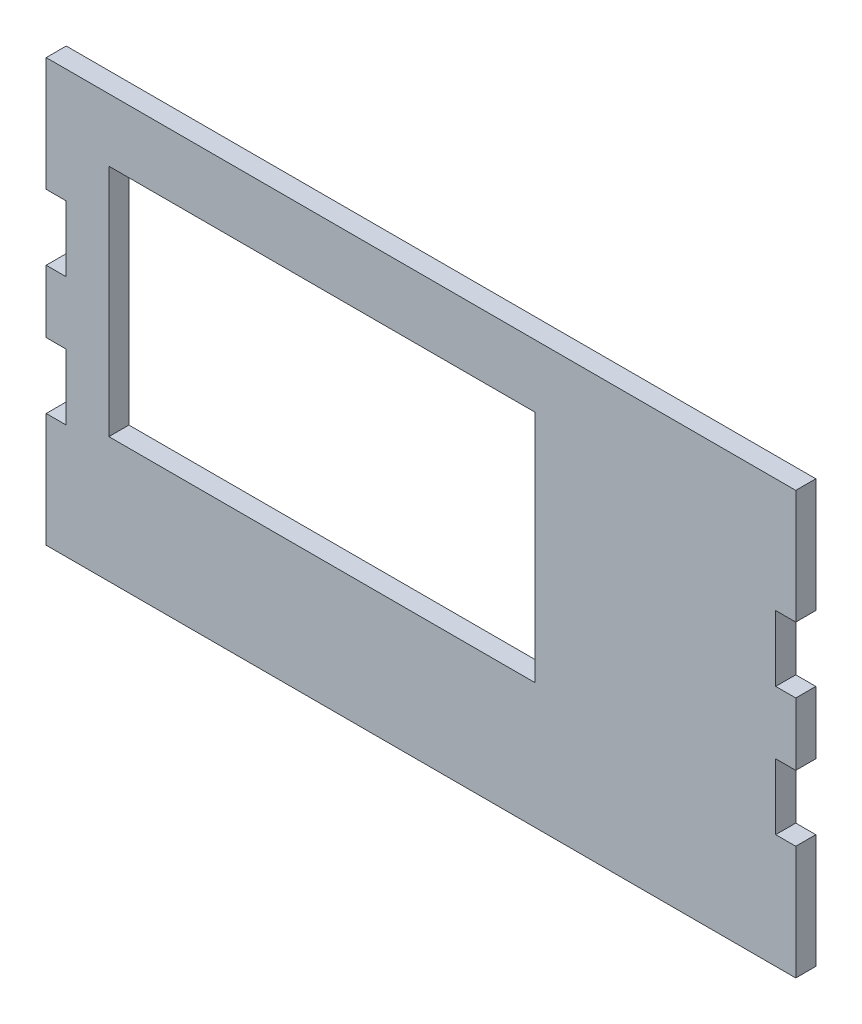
ISO-10303-21;
HEADER;
FILE_DESCRIPTION(('STEP AP214'),'2;1');
FILE_NAME('part.step','',(''),(''),'','','');
FILE_SCHEMA(('AUTOMOTIVE_DESIGN { 1 0 10303 214 1 1 1 1 }'));
ENDSEC;
DATA;
#1=APPLICATION_CONTEXT('core data for automotive mechanical design processes');
#2=APPLICATION_PROTOCOL_DEFINITION('international standard','automotive_design',2000,#1);
#3=PRODUCT_CONTEXT('',#1,'mechanical');
#4=PRODUCT('Part','Part','',(#3));
#5=PRODUCT_RELATED_PRODUCT_CATEGORY('part','',(#4));
#6=PRODUCT_DEFINITION_FORMATION('','',#4);
#7=PRODUCT_DEFINITION_CONTEXT('part definition',#1,'design');
#8=PRODUCT_DEFINITION('design','',#6,#7);
#9=PRODUCT_DEFINITION_SHAPE('','',#8);
#10=(LENGTH_UNIT() NAMED_UNIT(*) SI_UNIT(.MILLI.,.METRE.));
#11=(NAMED_UNIT(*) PLANE_ANGLE_UNIT() SI_UNIT($,.RADIAN.));
#12=(NAMED_UNIT(*) SI_UNIT($,.STERADIAN.) SOLID_ANGLE_UNIT());
#13=UNCERTAINTY_MEASURE_WITH_UNIT(LENGTH_MEASURE(1.E-05),#10,'distance_accuracy_value','');
#14=(GEOMETRIC_REPRESENTATION_CONTEXT(3) GLOBAL_UNCERTAINTY_ASSIGNED_CONTEXT((#13)) GLOBAL_UNIT_ASSIGNED_CONTEXT((#10,
#11,#12)) REPRESENTATION_CONTEXT('',''));
#15=CARTESIAN_POINT('',(0.,0.,0.));
#16=DIRECTION('',(0.,0.,1.));
#17=DIRECTION('',(1.,0.,0.));
#18=AXIS2_PLACEMENT_3D('',#15,#16,#17);
#19=CARTESIAN_POINT('',(581.8,-16.,16.));
#20=DIRECTION('',(0.,-1.,0.));
#21=DIRECTION('',(1.,0.,0.));
#22=AXIS2_PLACEMENT_3D('',#19,#20,#21);
#23=PLANE('',#22);
#24=DIRECTION('',(-1.,0.,0.));
#25=VECTOR('',#24,1.);
#26=CARTESIAN_POINT('',(581.8,-16.,0.));
#27=LINE('',#26,#25);
#28=CARTESIAN_POINT('',(581.8,-16.,0.));
#29=VERTEX_POINT('',#28);
#30=CARTESIAN_POINT('',(-16.,-16.0000000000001,0.));
#31=VERTEX_POINT('',#30);
#32=EDGE_CURVE('E312',#29,#31,#27,.T.);
#33=ORIENTED_EDGE('',*,*,#32,.F.);
#34=DIRECTION('',(0.,0.,-1.));
#35=VECTOR('',#34,1.);
#36=CARTESIAN_POINT('',(581.8,-16.,16.));
#37=LINE('',#36,#35);
#38=CARTESIAN_POINT('',(581.8,-16.,16.));
#39=VERTEX_POINT('',#38);
#40=EDGE_CURVE('E12',#39,#29,#37,.T.);
#41=ORIENTED_EDGE('',*,*,#40,.F.);
#42=DIRECTION('',(-1.,0.,0.));
#43=VECTOR('',#42,1.);
#44=CARTESIAN_POINT('',(581.8,-16.,16.));
#45=LINE('',#44,#43);
#46=CARTESIAN_POINT('',(-16.,-16.0000000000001,16.));
#47=VERTEX_POINT('',#46);
#48=EDGE_CURVE('E316',#39,#47,#45,.T.);
#49=ORIENTED_EDGE('',*,*,#48,.T.);
#50=DIRECTION('',(0.,0.,-1.));
#51=VECTOR('',#50,1.);
#52=CARTESIAN_POINT('',(-16.,-16.0000000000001,16.));
#53=LINE('',#52,#51);
#54=EDGE_CURVE('E123',#47,#31,#53,.T.);
#55=ORIENTED_EDGE('',*,*,#54,.T.);
#56=EDGE_LOOP('',(#33,#41,#49,#55));
#57=FACE_BOUND('',#56,.T.);
#58=ADVANCED_FACE('F120',(#57),#23,.T.);
#59=CARTESIAN_POINT('',(581.8,-16.,16.));
#60=DIRECTION('',(-1.,0.,0.));
#61=DIRECTION('',(0.,0.,1.));
#62=AXIS2_PLACEMENT_3D('',#59,#60,#61);
#63=PLANE('',#62);
#64=DIRECTION('',(0.,1.,0.));
#65=VECTOR('',#64,1.);
#66=CARTESIAN_POINT('',(581.8,-16.,0.));
#67=LINE('',#66,#65);
#68=CARTESIAN_POINT('',(581.8,75.,0.));
#69=VERTEX_POINT('',#68);
#70=EDGE_CURVE('E320',#29,#69,#67,.T.);
#71=ORIENTED_EDGE('',*,*,#70,.T.);
#72=DIRECTION('',(0.,0.,-1.));
#73=VECTOR('',#72,1.);
#74=CARTESIAN_POINT('',(581.8,75.,16.));
#75=LINE('',#74,#73);
#76=CARTESIAN_POINT('',(581.8,75.,16.));
#77=VERTEX_POINT('',#76);
#78=EDGE_CURVE('E128',#77,#69,#75,.T.);
#79=ORIENTED_EDGE('',*,*,#78,.F.);
#80=DIRECTION('',(0.,1.,0.));
#81=VECTOR('',#80,1.);
#82=CARTESIAN_POINT('',(581.8,-16.,16.));
#83=LINE('',#82,#81);
#84=EDGE_CURVE('E366',#39,#77,#83,.T.);
#85=ORIENTED_EDGE('',*,*,#84,.F.);
#86=ORIENTED_EDGE('',*,*,#40,.T.);
#87=EDGE_LOOP('',(#71,#79,#85,#86));
#88=FACE_BOUND('',#87,.T.);
#89=ADVANCED_FACE('F478',(#88),#63,.F.);
#90=CARTESIAN_POINT('',(565.8,75.,16.));
#91=DIRECTION('',(0.,1.,0.));
#92=DIRECTION('',(0.,0.,1.));
#93=AXIS2_PLACEMENT_3D('',#90,#91,#92);
#94=PLANE('',#93);
#95=DIRECTION('',(1.,0.,0.));
#96=VECTOR('',#95,1.);
#97=CARTESIAN_POINT('',(565.8,75.,0.));
#98=LINE('',#97,#96);
#99=CARTESIAN_POINT('',(565.8,75.,0.));
#100=VERTEX_POINT('',#99);
#101=EDGE_CURVE('E418',#100,#69,#98,.T.);
#102=ORIENTED_EDGE('',*,*,#101,.F.);
#103=DIRECTION('',(0.,0.,-1.));
#104=VECTOR('',#103,1.);
#105=CARTESIAN_POINT('',(565.8,75.,16.));
#106=LINE('',#105,#104);
#107=CARTESIAN_POINT('',(565.8,75.,16.));
#108=VERTEX_POINT('',#107);
#109=EDGE_CURVE('E424',#108,#100,#106,.T.);
#110=ORIENTED_EDGE('',*,*,#109,.F.);
#111=DIRECTION('',(1.,0.,0.));
#112=VECTOR('',#111,1.);
#113=CARTESIAN_POINT('',(565.8,75.,16.));
#114=LINE('',#113,#112);
#115=EDGE_CURVE('E363',#108,#77,#114,.T.);
#116=ORIENTED_EDGE('',*,*,#115,.T.);
#117=ORIENTED_EDGE('',*,*,#78,.T.);
#118=EDGE_LOOP('',(#102,#110,#116,#117));
#119=FACE_BOUND('',#118,.T.);
#120=ADVANCED_FACE('F548',(#119),#94,.T.);
#121=CARTESIAN_POINT('',(565.8,75.,16.));
#122=DIRECTION('',(-1.,0.,0.));
#123=DIRECTION('',(0.,0.,1.));
#124=AXIS2_PLACEMENT_3D('',#121,#122,#123);
#125=PLANE('',#124);
#126=DIRECTION('',(0.,1.,0.));
#127=VECTOR('',#126,1.);
#128=CARTESIAN_POINT('',(565.8,75.,0.));
#129=LINE('',#128,#127);
#130=CARTESIAN_POINT('',(565.8,127.4,0.));
#131=VERTEX_POINT('',#130);
#132=EDGE_CURVE('E416',#100,#131,#129,.T.);
#133=ORIENTED_EDGE('',*,*,#132,.T.);
#134=DIRECTION('',(0.,0.,-1.));
#135=VECTOR('',#134,1.);
#136=CARTESIAN_POINT('',(565.8,127.4,16.));
#137=LINE('',#136,#135);
#138=CARTESIAN_POINT('',(565.8,127.4,16.));
#139=VERTEX_POINT('',#138);
#140=EDGE_CURVE('E426',#139,#131,#137,.T.);
#141=ORIENTED_EDGE('',*,*,#140,.F.);
#142=DIRECTION('',(0.,1.,0.));
#143=VECTOR('',#142,1.);
#144=CARTESIAN_POINT('',(565.8,75.,16.));
#145=LINE('',#144,#143);
#146=EDGE_CURVE('E361',#108,#139,#145,.T.);
#147=ORIENTED_EDGE('',*,*,#146,.F.);
#148=ORIENTED_EDGE('',*,*,#109,.T.);
#149=EDGE_LOOP('',(#133,#141,#147,#148));
#150=FACE_BOUND('',#149,.T.);
#151=ADVANCED_FACE('F546',(#150),#125,.F.);
#152=CARTESIAN_POINT('',(565.8,127.4,16.));
#153=DIRECTION('',(0.,1.,0.));
#154=DIRECTION('',(-1.,0.,0.));
#155=AXIS2_PLACEMENT_3D('',#152,#153,#154);
#156=PLANE('',#155);
#157=DIRECTION('',(1.,0.,0.));
#158=VECTOR('',#157,1.);
#159=CARTESIAN_POINT('',(565.8,127.4,0.));
#160=LINE('',#159,#158);
#161=CARTESIAN_POINT('',(581.8,127.4,0.));
#162=VERTEX_POINT('',#161);
#163=EDGE_CURVE('E413',#131,#162,#160,.T.);
#164=ORIENTED_EDGE('',*,*,#163,.T.);
#165=DIRECTION('',(0.,0.,-1.));
#166=VECTOR('',#165,1.);
#167=CARTESIAN_POINT('',(581.8,127.4,16.));
#168=LINE('',#167,#166);
#169=CARTESIAN_POINT('',(581.8,127.4,16.));
#170=VERTEX_POINT('',#169);
#171=EDGE_CURVE('E429',#170,#162,#168,.T.);
#172=ORIENTED_EDGE('',*,*,#171,.F.);
#173=DIRECTION('',(1.,0.,0.));
#174=VECTOR('',#173,1.);
#175=CARTESIAN_POINT('',(565.8,127.4,16.));
#176=LINE('',#175,#174);
#177=EDGE_CURVE('E359',#139,#170,#176,.T.);
#178=ORIENTED_EDGE('',*,*,#177,.F.);
#179=ORIENTED_EDGE('',*,*,#140,.T.);
#180=EDGE_LOOP('',(#164,#172,#178,#179));
#181=FACE_BOUND('',#180,.T.);
#182=ADVANCED_FACE('F542',(#181),#156,.F.);
#183=CARTESIAN_POINT('',(581.8,177.4,16.));
#184=DIRECTION('',(1.,0.,0.));
#185=DIRECTION('',(0.,0.,-1.));
#186=AXIS2_PLACEMENT_3D('',#183,#184,#185);
#187=PLANE('',#186);
#188=DIRECTION('',(0.,-1.,0.));
#189=VECTOR('',#188,1.);
#190=CARTESIAN_POINT('',(581.8,177.4,0.));
#191=LINE('',#190,#189);
#192=CARTESIAN_POINT('',(581.8,177.4,0.));
#193=VERTEX_POINT('',#192);
#194=EDGE_CURVE('E410',#193,#162,#191,.T.);
#195=ORIENTED_EDGE('',*,*,#194,.F.);
#196=DIRECTION('',(0.,0.,-1.));
#197=VECTOR('',#196,1.);
#198=CARTESIAN_POINT('',(581.8,177.4,16.));
#199=LINE('',#198,#197);
#200=CARTESIAN_POINT('',(581.8,177.4,16.));
#201=VERTEX_POINT('',#200);
#202=EDGE_CURVE('E431',#201,#193,#199,.T.);
#203=ORIENTED_EDGE('',*,*,#202,.F.);
#204=DIRECTION('',(0.,-1.,0.));
#205=VECTOR('',#204,1.);
#206=CARTESIAN_POINT('',(581.8,177.4,16.));
#207=LINE('',#206,#205);
#208=EDGE_CURVE('E356',#201,#170,#207,.T.);
#209=ORIENTED_EDGE('',*,*,#208,.T.);
#210=ORIENTED_EDGE('',*,*,#171,.T.);
#211=EDGE_LOOP('',(#195,#203,#209,#210));
#212=FACE_BOUND('',#211,.T.);
#213=ADVANCED_FACE('F537',(#212),#187,.T.);
#214=CARTESIAN_POINT('',(565.8,177.4,16.));
#215=DIRECTION('',(0.,1.,0.));
#216=DIRECTION('',(0.,0.,1.));
#217=AXIS2_PLACEMENT_3D('',#214,#215,#216);
#218=PLANE('',#217);
#219=DIRECTION('',(1.,0.,0.));
#220=VECTOR('',#219,1.);
#221=CARTESIAN_POINT('',(565.8,177.4,0.));
#222=LINE('',#221,#220);
#223=CARTESIAN_POINT('',(565.8,177.4,0.));
#224=VERTEX_POINT('',#223);
#225=EDGE_CURVE('E407',#224,#193,#222,.T.);
#226=ORIENTED_EDGE('',*,*,#225,.F.);
#227=DIRECTION('',(0.,0.,-1.));
#228=VECTOR('',#227,1.);
#229=CARTESIAN_POINT('',(565.8,177.4,16.));
#230=LINE('',#229,#228);
#231=CARTESIAN_POINT('',(565.8,177.4,16.));
#232=VERTEX_POINT('',#231);
#233=EDGE_CURVE('E433',#232,#224,#230,.T.);
#234=ORIENTED_EDGE('',*,*,#233,.F.);
#235=DIRECTION('',(1.,0.,0.));
#236=VECTOR('',#235,1.);
#237=CARTESIAN_POINT('',(565.8,177.4,16.));
#238=LINE('',#237,#236);
#239=EDGE_CURVE('E353',#232,#201,#238,.T.);
#240=ORIENTED_EDGE('',*,*,#239,.T.);
#241=ORIENTED_EDGE('',*,*,#202,.T.);
#242=EDGE_LOOP('',(#226,#234,#240,#241));
#243=FACE_BOUND('',#242,.T.);
#244=ADVANCED_FACE('F533',(#243),#218,.T.);
#245=CARTESIAN_POINT('',(565.8,177.4,16.));
#246=DIRECTION('',(-1.,0.,0.));
#247=DIRECTION('',(0.,0.,1.));
#248=AXIS2_PLACEMENT_3D('',#245,#246,#247);
#249=PLANE('',#248);
#250=DIRECTION('',(0.,1.,0.));
#251=VECTOR('',#250,1.);
#252=CARTESIAN_POINT('',(565.8,177.4,0.));
#253=LINE('',#252,#251);
#254=CARTESIAN_POINT('',(565.8,229.8,0.));
#255=VERTEX_POINT('',#254);
#256=EDGE_CURVE('E405',#224,#255,#253,.T.);
#257=ORIENTED_EDGE('',*,*,#256,.T.);
#258=DIRECTION('',(0.,0.,-1.));
#259=VECTOR('',#258,1.);
#260=CARTESIAN_POINT('',(565.8,229.8,16.));
#261=LINE('',#260,#259);
#262=CARTESIAN_POINT('',(565.8,229.8,16.));
#263=VERTEX_POINT('',#262);
#264=EDGE_CURVE('E435',#263,#255,#261,.T.);
#265=ORIENTED_EDGE('',*,*,#264,.F.);
#266=DIRECTION('',(0.,1.,0.));
#267=VECTOR('',#266,1.);
#268=CARTESIAN_POINT('',(565.8,177.4,16.));
#269=LINE('',#268,#267);
#270=EDGE_CURVE('E351',#232,#263,#269,.T.);
#271=ORIENTED_EDGE('',*,*,#270,.F.);
#272=ORIENTED_EDGE('',*,*,#233,.T.);
#273=EDGE_LOOP('',(#257,#265,#271,#272));
#274=FACE_BOUND('',#273,.T.);
#275=ADVANCED_FACE('F530',(#274),#249,.F.);
#276=CARTESIAN_POINT('',(565.8,229.8,16.));
#277=DIRECTION('',(0.,1.,0.));
#278=DIRECTION('',(0.,0.,1.));
#279=AXIS2_PLACEMENT_3D('',#276,#277,#278);
#280=PLANE('',#279);
#281=DIRECTION('',(1.,0.,0.));
#282=VECTOR('',#281,1.);
#283=CARTESIAN_POINT('',(565.8,229.8,0.));
#284=LINE('',#283,#282);
#285=CARTESIAN_POINT('',(581.8,229.8,0.));
#286=VERTEX_POINT('',#285);
#287=EDGE_CURVE('E402',#255,#286,#284,.T.);
#288=ORIENTED_EDGE('',*,*,#287,.T.);
#289=DIRECTION('',(0.,0.,-1.));
#290=VECTOR('',#289,1.);
#291=CARTESIAN_POINT('',(581.8,229.8,16.));
#292=LINE('',#291,#290);
#293=CARTESIAN_POINT('',(581.8,229.8,16.));
#294=VERTEX_POINT('',#293);
#295=EDGE_CURVE('E438',#294,#286,#292,.T.);
#296=ORIENTED_EDGE('',*,*,#295,.F.);
#297=DIRECTION('',(1.,0.,0.));
#298=VECTOR('',#297,1.);
#299=CARTESIAN_POINT('',(565.8,229.8,16.));
#300=LINE('',#299,#298);
#301=EDGE_CURVE('E348',#263,#294,#300,.T.);
#302=ORIENTED_EDGE('',*,*,#301,.F.);
#303=ORIENTED_EDGE('',*,*,#264,.T.);
#304=EDGE_LOOP('',(#288,#296,#302,#303));
#305=FACE_BOUND('',#304,.T.);
#306=ADVANCED_FACE('F526',(#305),#280,.F.);
#307=CARTESIAN_POINT('',(581.8,304.8,16.));
#308=DIRECTION('',(1.,0.,0.));
#309=DIRECTION('',(0.,0.,-1.));
#310=AXIS2_PLACEMENT_3D('',#307,#308,#309);
#311=PLANE('',#310);
#312=DIRECTION('',(0.,-1.,0.));
#313=VECTOR('',#312,1.);
#314=CARTESIAN_POINT('',(581.8,304.8,0.));
#315=LINE('',#314,#313);
#316=CARTESIAN_POINT('',(581.8,320.8,0.));
#317=VERTEX_POINT('',#316);
#318=EDGE_CURVE('E399',#317,#286,#315,.T.);
#319=ORIENTED_EDGE('',*,*,#318,.F.);
#320=DIRECTION('',(0.,0.,-1.));
#321=VECTOR('',#320,1.);
#322=CARTESIAN_POINT('',(581.8,320.8,16.));
#323=LINE('',#322,#321);
#324=CARTESIAN_POINT('',(581.8,320.8,16.));
#325=VERTEX_POINT('',#324);
#326=EDGE_CURVE('E440',#325,#317,#323,.T.);
#327=ORIENTED_EDGE('',*,*,#326,.F.);
#328=DIRECTION('',(0.,1.,0.));
#329=VECTOR('',#328,1.);
#330=CARTESIAN_POINT('',(581.8,304.8,16.));
#331=LINE('',#330,#329);
#332=EDGE_CURVE('E345',#294,#325,#331,.T.);
#333=ORIENTED_EDGE('',*,*,#332,.F.);
#334=ORIENTED_EDGE('',*,*,#295,.T.);
#335=EDGE_LOOP('',(#319,#327,#333,#334));
#336=FACE_BOUND('',#335,.T.);
#337=ADVANCED_FACE('F521',(#336),#311,.T.);
#338=CARTESIAN_POINT('',(270.,320.8,16.));
#339=DIRECTION('',(0.,1.,0.));
#340=DIRECTION('',(0.,0.,1.));
#341=AXIS2_PLACEMENT_3D('',#338,#339,#340);
#342=PLANE('',#341);
#343=DIRECTION('',(1.,0.,0.));
#344=VECTOR('',#343,1.);
#345=CARTESIAN_POINT('',(270.,320.8,0.));
#346=LINE('',#345,#344);
#347=CARTESIAN_POINT('',(-16.,320.8,0.));
#348=VERTEX_POINT('',#347);
#349=EDGE_CURVE('E396',#348,#317,#346,.T.);
#350=ORIENTED_EDGE('',*,*,#349,.F.);
#351=DIRECTION('',(0.,0.,-1.));
#352=VECTOR('',#351,1.);
#353=CARTESIAN_POINT('',(-16.,320.8,16.));
#354=LINE('',#353,#352);
#355=CARTESIAN_POINT('',(-16.,320.8,16.));
#356=VERTEX_POINT('',#355);
#357=EDGE_CURVE('E443',#356,#348,#354,.T.);
#358=ORIENTED_EDGE('',*,*,#357,.F.);
#359=DIRECTION('',(1.,0.,0.));
#360=VECTOR('',#359,1.);
#361=CARTESIAN_POINT('',(-16.,320.8,16.));
#362=LINE('',#361,#360);
#363=EDGE_CURVE('E343',#356,#325,#362,.T.);
#364=ORIENTED_EDGE('',*,*,#363,.T.);
#365=ORIENTED_EDGE('',*,*,#326,.T.);
#366=EDGE_LOOP('',(#350,#358,#364,#365));
#367=FACE_BOUND('',#366,.T.);
#368=ADVANCED_FACE('F516',(#367),#342,.T.);
#369=CARTESIAN_POINT('',(-16.,304.8,16.));
#370=DIRECTION('',(-1.,0.,0.));
#371=DIRECTION('',(0.,0.,1.));
#372=AXIS2_PLACEMENT_3D('',#369,#370,#371);
#373=PLANE('',#372);
#374=DIRECTION('',(0.,1.,0.));
#375=VECTOR('',#374,1.);
#376=CARTESIAN_POINT('',(-16.,304.8,0.));
#377=LINE('',#376,#375);
#378=CARTESIAN_POINT('',(-16.,229.8,0.));
#379=VERTEX_POINT('',#378);
#380=EDGE_CURVE('E393',#379,#348,#377,.T.);
#381=ORIENTED_EDGE('',*,*,#380,.F.);
#382=DIRECTION('',(0.,0.,-1.));
#383=VECTOR('',#382,1.);
#384=CARTESIAN_POINT('',(-16.,229.8,16.));
#385=LINE('',#384,#383);
#386=CARTESIAN_POINT('',(-16.,229.8,16.));
#387=VERTEX_POINT('',#386);
#388=EDGE_CURVE('E446',#387,#379,#385,.T.);
#389=ORIENTED_EDGE('',*,*,#388,.F.);
#390=DIRECTION('',(0.,-1.,0.));
#391=VECTOR('',#390,1.);
#392=CARTESIAN_POINT('',(-16.,304.8,16.));
#393=LINE('',#392,#391);
#394=EDGE_CURVE('E341',#356,#387,#393,.T.);
#395=ORIENTED_EDGE('',*,*,#394,.F.);
#396=ORIENTED_EDGE('',*,*,#357,.T.);
#397=EDGE_LOOP('',(#381,#389,#395,#396));
#398=FACE_BOUND('',#397,.T.);
#399=ADVANCED_FACE('F512',(#398),#373,.T.);
#400=CARTESIAN_POINT('',(0.,229.8,16.));
#401=DIRECTION('',(0.,-1.,0.));
#402=DIRECTION('',(0.,0.,-1.));
#403=AXIS2_PLACEMENT_3D('',#400,#401,#402);
#404=PLANE('',#403);
#405=DIRECTION('',(-1.,0.,0.));
#406=VECTOR('',#405,1.);
#407=CARTESIAN_POINT('',(0.,229.8,0.));
#408=LINE('',#407,#406);
#409=CARTESIAN_POINT('',(0.,229.8,0.));
#410=VERTEX_POINT('',#409);
#411=EDGE_CURVE('E390',#410,#379,#408,.T.);
#412=ORIENTED_EDGE('',*,*,#411,.F.);
#413=DIRECTION('',(0.,0.,-1.));
#414=VECTOR('',#413,1.);
#415=CARTESIAN_POINT('',(0.,229.8,16.));
#416=LINE('',#415,#414);
#417=CARTESIAN_POINT('',(0.,229.8,16.));
#418=VERTEX_POINT('',#417);
#419=EDGE_CURVE('E449',#418,#410,#416,.T.);
#420=ORIENTED_EDGE('',*,*,#419,.F.);
#421=DIRECTION('',(-1.,0.,0.));
#422=VECTOR('',#421,1.);
#423=CARTESIAN_POINT('',(0.,229.8,16.));
#424=LINE('',#423,#422);
#425=EDGE_CURVE('E338',#418,#387,#424,.T.);
#426=ORIENTED_EDGE('',*,*,#425,.T.);
#427=ORIENTED_EDGE('',*,*,#388,.T.);
#428=EDGE_LOOP('',(#412,#420,#426,#427));
#429=FACE_BOUND('',#428,.T.);
#430=ADVANCED_FACE('F508',(#429),#404,.T.);
#431=CARTESIAN_POINT('',(0.,177.4,16.));
#432=DIRECTION('',(-1.,0.,0.));
#433=DIRECTION('',(0.,0.,1.));
#434=AXIS2_PLACEMENT_3D('',#431,#432,#433);
#435=PLANE('',#434);
#436=DIRECTION('',(0.,1.,0.));
#437=VECTOR('',#436,1.);
#438=CARTESIAN_POINT('',(0.,177.4,0.));
#439=LINE('',#438,#437);
#440=CARTESIAN_POINT('',(0.,177.4,0.));
#441=VERTEX_POINT('',#440);
#442=EDGE_CURVE('E387',#441,#410,#439,.T.);
#443=ORIENTED_EDGE('',*,*,#442,.F.);
#444=DIRECTION('',(0.,0.,-1.));
#445=VECTOR('',#444,1.);
#446=CARTESIAN_POINT('',(0.,177.4,16.));
#447=LINE('',#446,#445);
#448=CARTESIAN_POINT('',(0.,177.4,16.));
#449=VERTEX_POINT('',#448);
#450=EDGE_CURVE('E451',#449,#441,#447,.T.);
#451=ORIENTED_EDGE('',*,*,#450,.F.);
#452=DIRECTION('',(0.,1.,0.));
#453=VECTOR('',#452,1.);
#454=CARTESIAN_POINT('',(0.,177.4,16.));
#455=LINE('',#454,#453);
#456=EDGE_CURVE('E335',#449,#418,#455,.T.);
#457=ORIENTED_EDGE('',*,*,#456,.T.);
#458=ORIENTED_EDGE('',*,*,#419,.T.);
#459=EDGE_LOOP('',(#443,#451,#457,#458));
#460=FACE_BOUND('',#459,.T.);
#461=ADVANCED_FACE('F505',(#460),#435,.T.);
#462=CARTESIAN_POINT('',(0.,177.4,16.));
#463=DIRECTION('',(0.,-1.,0.));
#464=DIRECTION('',(0.,0.,-1.));
#465=AXIS2_PLACEMENT_3D('',#462,#463,#464);
#466=PLANE('',#465);
#467=DIRECTION('',(-1.,0.,0.));
#468=VECTOR('',#467,1.);
#469=CARTESIAN_POINT('',(0.,177.4,0.));
#470=LINE('',#469,#468);
#471=CARTESIAN_POINT('',(-16.,177.4,0.));
#472=VERTEX_POINT('',#471);
#473=EDGE_CURVE('E385',#441,#472,#470,.T.);
#474=ORIENTED_EDGE('',*,*,#473,.T.);
#475=DIRECTION('',(0.,0.,-1.));
#476=VECTOR('',#475,1.);
#477=CARTESIAN_POINT('',(-16.,177.4,16.));
#478=LINE('',#477,#476);
#479=CARTESIAN_POINT('',(-16.,177.4,16.));
#480=VERTEX_POINT('',#479);
#481=EDGE_CURVE('E453',#480,#472,#478,.T.);
#482=ORIENTED_EDGE('',*,*,#481,.F.);
#483=DIRECTION('',(-1.,0.,0.));
#484=VECTOR('',#483,1.);
#485=CARTESIAN_POINT('',(0.,177.4,16.));
#486=LINE('',#485,#484);
#487=EDGE_CURVE('E333',#449,#480,#486,.T.);
#488=ORIENTED_EDGE('',*,*,#487,.F.);
#489=ORIENTED_EDGE('',*,*,#450,.T.);
#490=EDGE_LOOP('',(#474,#482,#488,#489));
#491=FACE_BOUND('',#490,.T.);
#492=ADVANCED_FACE('F502',(#491),#466,.F.);
#493=CARTESIAN_POINT('',(-16.,177.4,16.));
#494=DIRECTION('',(1.,0.,0.));
#495=DIRECTION('',(0.,0.,-1.));
#496=AXIS2_PLACEMENT_3D('',#493,#494,#495);
#497=PLANE('',#496);
#498=DIRECTION('',(0.,-1.,0.));
#499=VECTOR('',#498,1.);
#500=CARTESIAN_POINT('',(-16.,177.4,0.));
#501=LINE('',#500,#499);
#502=CARTESIAN_POINT('',(-16.,127.4,0.));
#503=VERTEX_POINT('',#502);
#504=EDGE_CURVE('E382',#472,#503,#501,.T.);
#505=ORIENTED_EDGE('',*,*,#504,.T.);
#506=DIRECTION('',(0.,0.,-1.));
#507=VECTOR('',#506,1.);
#508=CARTESIAN_POINT('',(-16.,127.4,16.));
#509=LINE('',#508,#507);
#510=CARTESIAN_POINT('',(-16.,127.4,16.));
#511=VERTEX_POINT('',#510);
#512=EDGE_CURVE('E456',#511,#503,#509,.T.);
#513=ORIENTED_EDGE('',*,*,#512,.F.);
#514=DIRECTION('',(0.,-1.,0.));
#515=VECTOR('',#514,1.);
#516=CARTESIAN_POINT('',(-16.,177.4,16.));
#517=LINE('',#516,#515);
#518=EDGE_CURVE('E331',#480,#511,#517,.T.);
#519=ORIENTED_EDGE('',*,*,#518,.F.);
#520=ORIENTED_EDGE('',*,*,#481,.T.);
#521=EDGE_LOOP('',(#505,#513,#519,#520));
#522=FACE_BOUND('',#521,.T.);
#523=ADVANCED_FACE('F497',(#522),#497,.F.);
#524=CARTESIAN_POINT('',(0.,127.4,16.));
#525=DIRECTION('',(0.,-1.,0.));
#526=DIRECTION('',(0.,0.,-1.));
#527=AXIS2_PLACEMENT_3D('',#524,#525,#526);
#528=PLANE('',#527);
#529=DIRECTION('',(-1.,0.,0.));
#530=VECTOR('',#529,1.);
#531=CARTESIAN_POINT('',(0.,127.4,0.));
#532=LINE('',#531,#530);
#533=CARTESIAN_POINT('',(0.,127.4,0.));
#534=VERTEX_POINT('',#533);
#535=EDGE_CURVE('E379',#534,#503,#532,.T.);
#536=ORIENTED_EDGE('',*,*,#535,.F.);
#537=DIRECTION('',(0.,0.,-1.));
#538=VECTOR('',#537,1.);
#539=CARTESIAN_POINT('',(0.,127.4,16.));
#540=LINE('',#539,#538);
#541=CARTESIAN_POINT('',(0.,127.4,16.));
#542=VERTEX_POINT('',#541);
#543=EDGE_CURVE('E458',#542,#534,#540,.T.);
#544=ORIENTED_EDGE('',*,*,#543,.F.);
#545=DIRECTION('',(-1.,0.,0.));
#546=VECTOR('',#545,1.);
#547=CARTESIAN_POINT('',(0.,127.4,16.));
#548=LINE('',#547,#546);
#549=EDGE_CURVE('E328',#542,#511,#548,.T.);
#550=ORIENTED_EDGE('',*,*,#549,.T.);
#551=ORIENTED_EDGE('',*,*,#512,.T.);
#552=EDGE_LOOP('',(#536,#544,#550,#551));
#553=FACE_BOUND('',#552,.T.);
#554=ADVANCED_FACE('F491',(#553),#528,.T.);
#555=CARTESIAN_POINT('',(0.,74.9999999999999,16.));
#556=DIRECTION('',(-1.,0.,0.));
#557=DIRECTION('',(0.,0.,1.));
#558=AXIS2_PLACEMENT_3D('',#555,#556,#557);
#559=PLANE('',#558);
#560=DIRECTION('',(0.,1.,0.));
#561=VECTOR('',#560,1.);
#562=CARTESIAN_POINT('',(0.,74.9999999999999,0.));
#563=LINE('',#562,#561);
#564=CARTESIAN_POINT('',(0.,74.9999999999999,0.));
#565=VERTEX_POINT('',#564);
#566=EDGE_CURVE('E376',#565,#534,#563,.T.);
#567=ORIENTED_EDGE('',*,*,#566,.F.);
#568=DIRECTION('',(0.,0.,-1.));
#569=VECTOR('',#568,1.);
#570=CARTESIAN_POINT('',(0.,74.9999999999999,16.));
#571=LINE('',#570,#569);
#572=CARTESIAN_POINT('',(0.,74.9999999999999,16.));
#573=VERTEX_POINT('',#572);
#574=EDGE_CURVE('E460',#573,#565,#571,.T.);
#575=ORIENTED_EDGE('',*,*,#574,.F.);
#576=DIRECTION('',(0.,1.,0.));
#577=VECTOR('',#576,1.);
#578=CARTESIAN_POINT('',(0.,74.9999999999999,16.));
#579=LINE('',#578,#577);
#580=EDGE_CURVE('E325',#573,#542,#579,.T.);
#581=ORIENTED_EDGE('',*,*,#580,.T.);
#582=ORIENTED_EDGE('',*,*,#543,.T.);
#583=EDGE_LOOP('',(#567,#575,#581,#582));
#584=FACE_BOUND('',#583,.T.);
#585=ADVANCED_FACE('F488',(#584),#559,.T.);
#586=CARTESIAN_POINT('',(0.,74.9999999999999,16.));
#587=DIRECTION('',(0.,-1.,0.));
#588=DIRECTION('',(1.,0.,0.));
#589=AXIS2_PLACEMENT_3D('',#586,#587,#588);
#590=PLANE('',#589);
#591=DIRECTION('',(-1.,0.,0.));
#592=VECTOR('',#591,1.);
#593=CARTESIAN_POINT('',(0.,74.9999999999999,0.));
#594=LINE('',#593,#592);
#595=CARTESIAN_POINT('',(-16.,74.9999999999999,0.));
#596=VERTEX_POINT('',#595);
#597=EDGE_CURVE('E373',#565,#596,#594,.T.);
#598=ORIENTED_EDGE('',*,*,#597,.T.);
#599=DIRECTION('',(0.,0.,-1.));
#600=VECTOR('',#599,1.);
#601=CARTESIAN_POINT('',(-16.,74.9999999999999,16.));
#602=LINE('',#601,#600);
#603=CARTESIAN_POINT('',(-16.,74.9999999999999,16.));
#604=VERTEX_POINT('',#603);
#605=EDGE_CURVE('E461',#604,#596,#602,.T.);
#606=ORIENTED_EDGE('',*,*,#605,.F.);
#607=DIRECTION('',(-1.,0.,0.));
#608=VECTOR('',#607,1.);
#609=CARTESIAN_POINT('',(0.,74.9999999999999,16.));
#610=LINE('',#609,#608);
#611=EDGE_CURVE('E323',#573,#604,#610,.T.);
#612=ORIENTED_EDGE('',*,*,#611,.F.);
#613=ORIENTED_EDGE('',*,*,#574,.T.);
#614=EDGE_LOOP('',(#598,#606,#612,#613));
#615=FACE_BOUND('',#614,.T.);
#616=ADVANCED_FACE('F485',(#615),#590,.F.);
#617=CARTESIAN_POINT('',(-16.,-16.0000000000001,16.));
#618=DIRECTION('',(-1.,0.,0.));
#619=DIRECTION('',(0.,0.,1.));
#620=AXIS2_PLACEMENT_3D('',#617,#618,#619);
#621=PLANE('',#620);
#622=DIRECTION('',(0.,1.,0.));
#623=VECTOR('',#622,1.);
#624=CARTESIAN_POINT('',(-16.,-16.0000000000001,0.));
#625=LINE('',#624,#623);
#626=EDGE_CURVE('E370',#31,#596,#625,.T.);
#627=ORIENTED_EDGE('',*,*,#626,.F.);
#628=ORIENTED_EDGE('',*,*,#54,.F.);
#629=DIRECTION('',(0.,1.,0.));
#630=VECTOR('',#629,1.);
#631=CARTESIAN_POINT('',(-16.,-16.0000000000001,16.));
#632=LINE('',#631,#630);
#633=EDGE_CURVE('E319',#47,#604,#632,.T.);
#634=ORIENTED_EDGE('',*,*,#633,.T.);
#635=ORIENTED_EDGE('',*,*,#605,.T.);
#636=EDGE_LOOP('',(#627,#628,#634,#635));
#637=FACE_BOUND('',#636,.T.);
#638=ADVANCED_FACE('F469',(#637),#621,.T.);
#639=CARTESIAN_POINT('',(0.,0.,16.));
#640=DIRECTION('',(0.,0.,-1.));
#641=DIRECTION('',(-1.,0.,0.));
#642=AXIS2_PLACEMENT_3D('',#639,#640,#641);
#643=PLANE('',#642);
#644=DIRECTION('',(0.,-1.,0.));
#645=VECTOR('',#644,1.);
#646=CARTESIAN_POINT('',(34.,270.8,16.));
#647=LINE('',#646,#645);
#648=CARTESIAN_POINT('',(34.,270.8,16.));
#649=VERTEX_POINT('',#648);
#650=CARTESIAN_POINT('',(34.,83.9999999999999,16.));
#651=VERTEX_POINT('',#650);
#652=EDGE_CURVE('E286',#649,#651,#647,.T.);
#653=ORIENTED_EDGE('',*,*,#652,.F.);
#654=DIRECTION('',(1.,0.,0.));
#655=VECTOR('',#654,1.);
#656=CARTESIAN_POINT('',(34.,270.8,16.));
#657=LINE('',#656,#655);
#658=CARTESIAN_POINT('',(374.,270.8,16.));
#659=VERTEX_POINT('',#658);
#660=EDGE_CURVE('E283',#649,#659,#657,.T.);
#661=ORIENTED_EDGE('',*,*,#660,.T.);
#662=DIRECTION('',(0.,-1.,0.));
#663=VECTOR('',#662,1.);
#664=CARTESIAN_POINT('',(374.,270.8,16.));
#665=LINE('',#664,#663);
#666=CARTESIAN_POINT('',(374.,83.9999999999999,16.));
#667=VERTEX_POINT('',#666);
#668=EDGE_CURVE('E289',#659,#667,#665,.T.);
#669=ORIENTED_EDGE('',*,*,#668,.T.);
#670=DIRECTION('',(1.,0.,0.));
#671=VECTOR('',#670,1.);
#672=CARTESIAN_POINT('',(34.,83.9999999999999,16.));
#673=LINE('',#672,#671);
#674=EDGE_CURVE('E293',#651,#667,#673,.T.);
#675=ORIENTED_EDGE('',*,*,#674,.F.);
#676=EDGE_LOOP('',(#653,#661,#669,#675));
#677=FACE_BOUND('',#676,.T.);
#678=ORIENTED_EDGE('',*,*,#48,.F.);
#679=ORIENTED_EDGE('',*,*,#84,.T.);
#680=ORIENTED_EDGE('',*,*,#115,.F.);
#681=ORIENTED_EDGE('',*,*,#146,.T.);
#682=ORIENTED_EDGE('',*,*,#177,.T.);
#683=ORIENTED_EDGE('',*,*,#208,.F.);
#684=ORIENTED_EDGE('',*,*,#239,.F.);
#685=ORIENTED_EDGE('',*,*,#270,.T.);
#686=ORIENTED_EDGE('',*,*,#301,.T.);
#687=ORIENTED_EDGE('',*,*,#332,.T.);
#688=ORIENTED_EDGE('',*,*,#363,.F.);
#689=ORIENTED_EDGE('',*,*,#394,.T.);
#690=ORIENTED_EDGE('',*,*,#425,.F.);
#691=ORIENTED_EDGE('',*,*,#456,.F.);
#692=ORIENTED_EDGE('',*,*,#487,.T.);
#693=ORIENTED_EDGE('',*,*,#518,.T.);
#694=ORIENTED_EDGE('',*,*,#549,.F.);
#695=ORIENTED_EDGE('',*,*,#580,.F.);
#696=ORIENTED_EDGE('',*,*,#611,.T.);
#697=ORIENTED_EDGE('',*,*,#633,.F.);
#698=EDGE_LOOP('',(#678,#679,#680,#681,#682,#683,#684,#685,#686,#687,#688,#689,#690,#691,#692,
#693,#694,#695,#696,#697));
#699=FACE_BOUND('',#698,.T.);
#700=ADVANCED_FACE('F295',(#677,#699),#643,.F.);
#701=CARTESIAN_POINT('',(0.,0.,0.));
#702=DIRECTION('',(0.,0.,-1.));
#703=DIRECTION('',(-1.,0.,0.));
#704=AXIS2_PLACEMENT_3D('',#701,#702,#703);
#705=PLANE('',#704);
#706=DIRECTION('',(1.,0.,0.));
#707=VECTOR('',#706,1.);
#708=CARTESIAN_POINT('',(34.,270.8,0.));
#709=LINE('',#708,#707);
#710=CARTESIAN_POINT('',(34.,270.8,0.));
#711=VERTEX_POINT('',#710);
#712=CARTESIAN_POINT('',(374.,270.8,0.));
#713=VERTEX_POINT('',#712);
#714=EDGE_CURVE('E144',#711,#713,#709,.T.);
#715=ORIENTED_EDGE('',*,*,#714,.F.);
#716=DIRECTION('',(0.,-1.,0.));
#717=VECTOR('',#716,1.);
#718=CARTESIAN_POINT('',(34.,270.8,0.));
#719=LINE('',#718,#717);
#720=CARTESIAN_POINT('',(34.,83.9999999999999,0.));
#721=VERTEX_POINT('',#720);
#722=EDGE_CURVE('E297',#711,#721,#719,.T.);
#723=ORIENTED_EDGE('',*,*,#722,.T.);
#724=DIRECTION('',(1.,0.,0.));
#725=VECTOR('',#724,1.);
#726=CARTESIAN_POINT('',(34.,83.9999999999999,0.));
#727=LINE('',#726,#725);
#728=CARTESIAN_POINT('',(374.,83.9999999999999,0.));
#729=VERTEX_POINT('',#728);
#730=EDGE_CURVE('E300',#721,#729,#727,.T.);
#731=ORIENTED_EDGE('',*,*,#730,.T.);
#732=DIRECTION('',(0.,-1.,0.));
#733=VECTOR('',#732,1.);
#734=CARTESIAN_POINT('',(374.,270.8,0.));
#735=LINE('',#734,#733);
#736=EDGE_CURVE('E306',#713,#729,#735,.T.);
#737=ORIENTED_EDGE('',*,*,#736,.F.);
#738=EDGE_LOOP('',(#715,#723,#731,#737));
#739=FACE_BOUND('',#738,.T.);
#740=ORIENTED_EDGE('',*,*,#32,.T.);
#741=ORIENTED_EDGE('',*,*,#626,.T.);
#742=ORIENTED_EDGE('',*,*,#597,.F.);
#743=ORIENTED_EDGE('',*,*,#566,.T.);
#744=ORIENTED_EDGE('',*,*,#535,.T.);
#745=ORIENTED_EDGE('',*,*,#504,.F.);
#746=ORIENTED_EDGE('',*,*,#473,.F.);
#747=ORIENTED_EDGE('',*,*,#442,.T.);
#748=ORIENTED_EDGE('',*,*,#411,.T.);
#749=ORIENTED_EDGE('',*,*,#380,.T.);
#750=ORIENTED_EDGE('',*,*,#349,.T.);
#751=ORIENTED_EDGE('',*,*,#318,.T.);
#752=ORIENTED_EDGE('',*,*,#287,.F.);
#753=ORIENTED_EDGE('',*,*,#256,.F.);
#754=ORIENTED_EDGE('',*,*,#225,.T.);
#755=ORIENTED_EDGE('',*,*,#194,.T.);
#756=ORIENTED_EDGE('',*,*,#163,.F.);
#757=ORIENTED_EDGE('',*,*,#132,.F.);
#758=ORIENTED_EDGE('',*,*,#101,.T.);
#759=ORIENTED_EDGE('',*,*,#70,.F.);
#760=EDGE_LOOP('',(#740,#741,#742,#743,#744,#745,#746,#747,#748,#749,#750,#751,#752,#753,#754,
#755,#756,#757,#758,#759));
#761=FACE_BOUND('',#760,.T.);
#762=ADVANCED_FACE('F473',(#739,#761),#705,.T.);
#763=CARTESIAN_POINT('',(34.,270.8,16.));
#764=DIRECTION('',(0.,1.,0.));
#765=DIRECTION('',(0.,0.,1.));
#766=AXIS2_PLACEMENT_3D('',#763,#764,#765);
#767=PLANE('',#766);
#768=ORIENTED_EDGE('',*,*,#714,.T.);
#769=DIRECTION('',(0.,0.,-1.));
#770=VECTOR('',#769,1.);
#771=CARTESIAN_POINT('',(374.,270.8,16.));
#772=LINE('',#771,#770);
#773=EDGE_CURVE('E280',#659,#713,#772,.T.);
#774=ORIENTED_EDGE('',*,*,#773,.F.);
#775=ORIENTED_EDGE('',*,*,#660,.F.);
#776=DIRECTION('',(0.,0.,-1.));
#777=VECTOR('',#776,1.);
#778=CARTESIAN_POINT('',(34.,270.8,16.));
#779=LINE('',#778,#777);
#780=EDGE_CURVE('E310',#649,#711,#779,.T.);
#781=ORIENTED_EDGE('',*,*,#780,.T.);
#782=EDGE_LOOP('',(#768,#774,#775,#781));
#783=FACE_BOUND('',#782,.T.);
#784=ADVANCED_FACE('F281',(#783),#767,.F.);
#785=CARTESIAN_POINT('',(34.,270.8,16.));
#786=DIRECTION('',(1.,0.,0.));
#787=DIRECTION('',(0.,1.,0.));
#788=AXIS2_PLACEMENT_3D('',#785,#786,#787);
#789=PLANE('',#788);
#790=ORIENTED_EDGE('',*,*,#722,.F.);
#791=ORIENTED_EDGE('',*,*,#780,.F.);
#792=ORIENTED_EDGE('',*,*,#652,.T.);
#793=DIRECTION('',(0.,0.,-1.));
#794=VECTOR('',#793,1.);
#795=CARTESIAN_POINT('',(34.,83.9999999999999,16.));
#796=LINE('',#795,#794);
#797=EDGE_CURVE('E313',#651,#721,#796,.T.);
#798=ORIENTED_EDGE('',*,*,#797,.T.);
#799=EDGE_LOOP('',(#790,#791,#792,#798));
#800=FACE_BOUND('',#799,.T.);
#801=ADVANCED_FACE('F700',(#800),#789,.T.);
#802=CARTESIAN_POINT('',(34.,83.9999999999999,16.));
#803=DIRECTION('',(0.,1.,0.));
#804=DIRECTION('',(0.,0.,1.));
#805=AXIS2_PLACEMENT_3D('',#802,#803,#804);
#806=PLANE('',#805);
#807=ORIENTED_EDGE('',*,*,#730,.F.);
#808=ORIENTED_EDGE('',*,*,#797,.F.);
#809=ORIENTED_EDGE('',*,*,#674,.T.);
#810=DIRECTION('',(0.,0.,-1.));
#811=VECTOR('',#810,1.);
#812=CARTESIAN_POINT('',(374.,83.9999999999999,16.));
#813=LINE('',#812,#811);
#814=EDGE_CURVE('E136',#667,#729,#813,.T.);
#815=ORIENTED_EDGE('',*,*,#814,.T.);
#816=EDGE_LOOP('',(#807,#808,#809,#815));
#817=FACE_BOUND('',#816,.T.);
#818=ADVANCED_FACE('F707',(#817),#806,.T.);
#819=CARTESIAN_POINT('',(374.,270.8,16.));
#820=DIRECTION('',(1.,0.,0.));
#821=DIRECTION('',(0.,0.,-1.));
#822=AXIS2_PLACEMENT_3D('',#819,#820,#821);
#823=PLANE('',#822);
#824=ORIENTED_EDGE('',*,*,#736,.T.);
#825=ORIENTED_EDGE('',*,*,#814,.F.);
#826=ORIENTED_EDGE('',*,*,#668,.F.);
#827=ORIENTED_EDGE('',*,*,#773,.T.);
#828=EDGE_LOOP('',(#824,#825,#826,#827));
#829=FACE_BOUND('',#828,.T.);
#830=ADVANCED_FACE('F290',(#829),#823,.F.);
#831=CLOSED_SHELL('',(#58,#89,#120,#151,#182,#213,#244,#275,#306,#337,#368,#399,#430,#461,#492,
#523,#554,#585,#616,#638,#700,#762,#784,#801,#818,#830));
#832=MANIFOLD_SOLID_BREP('B2',#831);
#833=ADVANCED_BREP_SHAPE_REPRESENTATION('',(#18,#832),#14);
#834=SHAPE_DEFINITION_REPRESENTATION(#9,#833);
ENDSEC;
END-ISO-10303-21;
